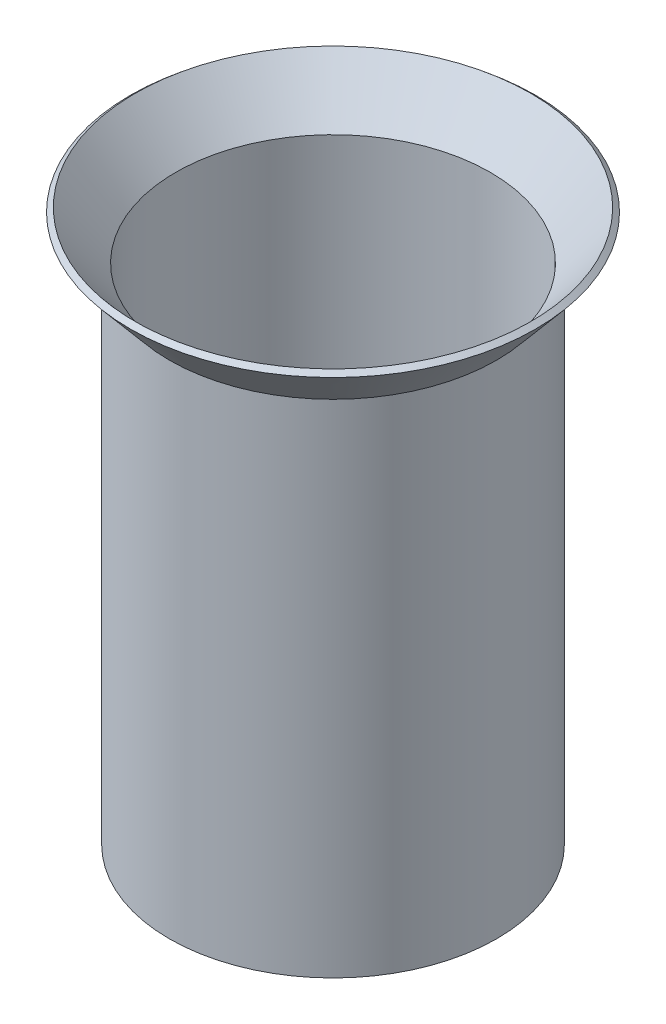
from build123d import *


with BuildPart() as part:
    # Skizze1 → Rotation-D_nn1 (revolve)
    with BuildSketch(Plane.XY, mode=Mode.PRIVATE) as rotation_d_nn1_sk:
        Polygon((25, 0), (25, 80), (31.427876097, 87.660444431), (32.19392054, 87.017656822), (26, 79.636029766), (26, 0), align=None)
    revolve(rotation_d_nn1_sk.sketch.rotate(Axis((0, 0, 0), (0, 1, 0)), 90), axis=Axis((0, 0, 0), (0, 1, 0)))


solid = part.part
